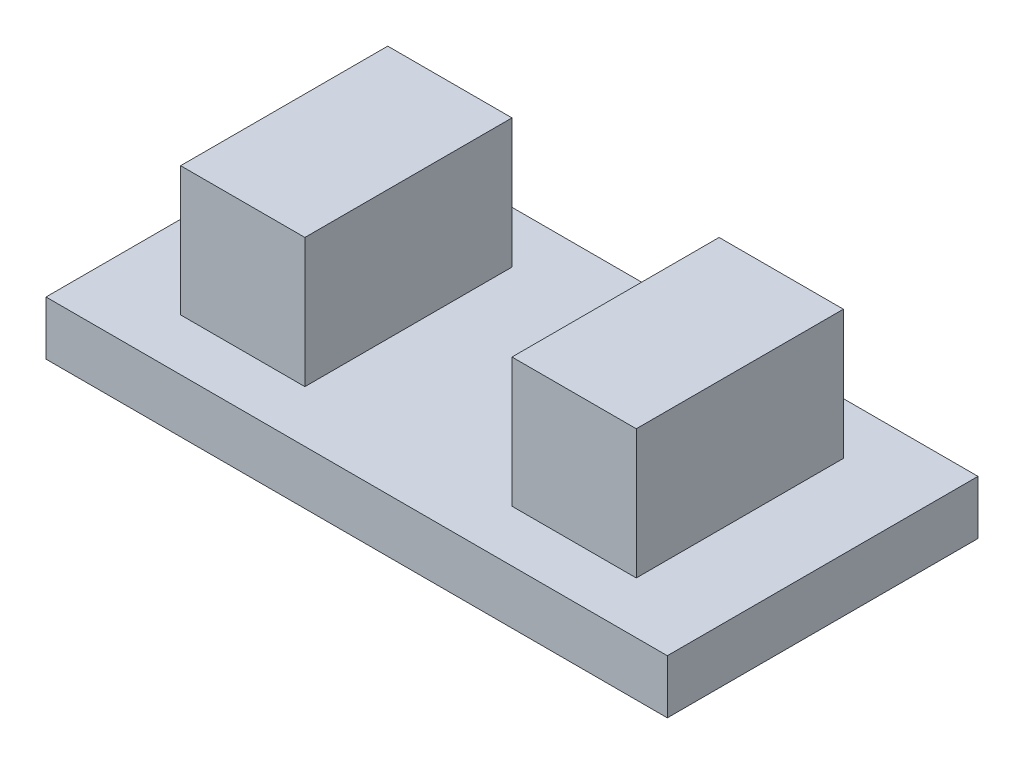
from build123d import *

# Parameters (mm, degrees)
SKETCH1_W      = 150
SKETCH1_H      = 75
EXTRUDE1_DEPTH = 13
SKETCH2_W      = 30
SKETCH2_H      = 50
EXTRUDE2_DEPTH = 31.199141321


with BuildPart() as part:
    # Sketch1 → Extrude1 (new body)
    with BuildSketch(Plane(origin=(0, 0, 0), x_dir=(1, 0, 0), z_dir=(0, 1, 0))):
        Rectangle(SKETCH1_W, SKETCH1_H)
    extrude(amount=EXTRUDE1_DEPTH)


with BuildPart() as body_2:
    # Sketch2 → Extrude2 (new body)
    with BuildSketch(Plane(origin=(0, 13, 0), x_dir=(1, 0, 0), z_dir=(0, 1, 0))):
        with Locations((-40, 0)):
            Rectangle(SKETCH2_W, SKETCH2_H)
    extrude(amount=EXTRUDE2_DEPTH)


with BuildPart() as body_3:
    # Mirror4: mirrored copy
    add(body_2.part.mirror(Plane(origin=(0, 0, 0), x_dir=(0, 0, 1), z_dir=(1, 0, 0))))


solid = Compound([part.part, body_2.part, body_3.part])
